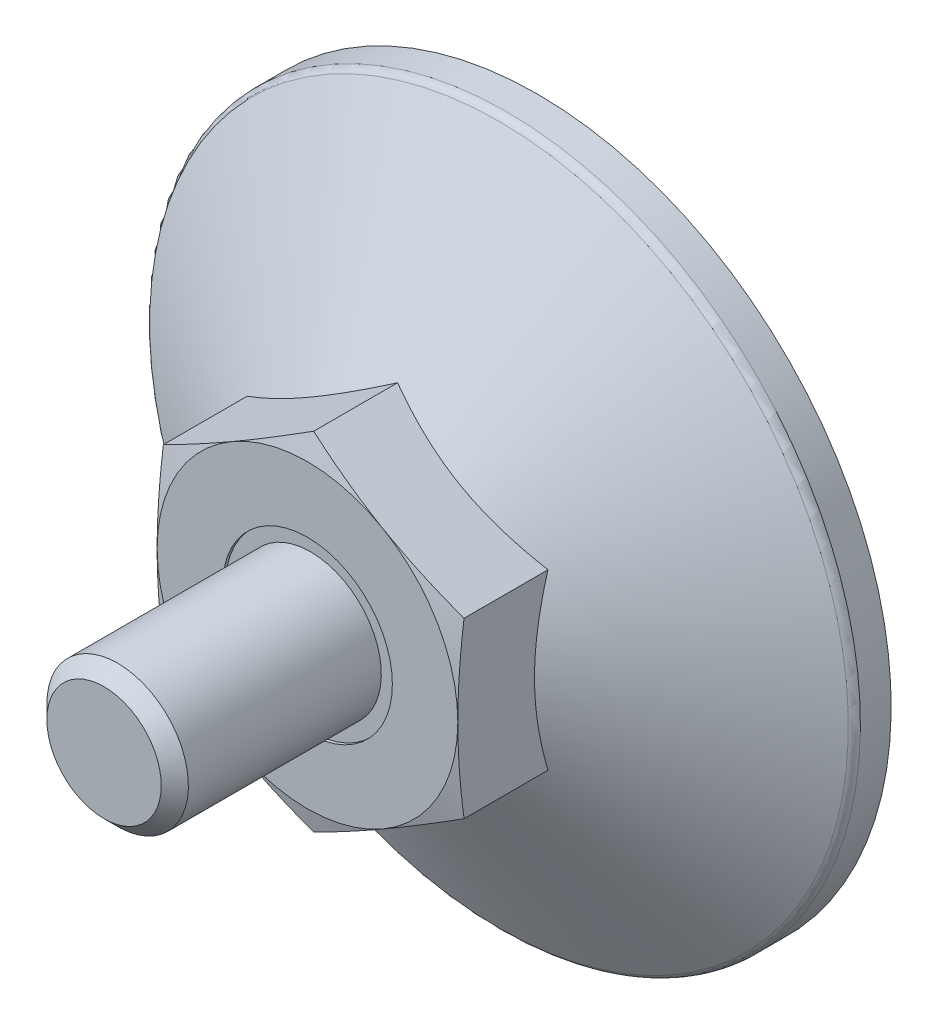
ISO-10303-21;
HEADER;
FILE_DESCRIPTION(('STEP AP214'),'2;1');
FILE_NAME('part.step','',(''),(''),'','','');
FILE_SCHEMA(('AUTOMOTIVE_DESIGN { 1 0 10303 214 1 1 1 1 }'));
ENDSEC;
DATA;
#1=APPLICATION_CONTEXT('core data for automotive mechanical design processes');
#2=APPLICATION_PROTOCOL_DEFINITION('international standard','automotive_design',2000,#1);
#3=PRODUCT_CONTEXT('',#1,'mechanical');
#4=PRODUCT('Part','Part','',(#3));
#5=PRODUCT_RELATED_PRODUCT_CATEGORY('part','',(#4));
#6=PRODUCT_DEFINITION_FORMATION('','',#4);
#7=PRODUCT_DEFINITION_CONTEXT('part definition',#1,'design');
#8=PRODUCT_DEFINITION('design','',#6,#7);
#9=PRODUCT_DEFINITION_SHAPE('','',#8);
#10=(LENGTH_UNIT() NAMED_UNIT(*) SI_UNIT(.MILLI.,.METRE.));
#11=(NAMED_UNIT(*) PLANE_ANGLE_UNIT() SI_UNIT($,.RADIAN.));
#12=(NAMED_UNIT(*) SI_UNIT($,.STERADIAN.) SOLID_ANGLE_UNIT());
#13=UNCERTAINTY_MEASURE_WITH_UNIT(LENGTH_MEASURE(1.E-05),#10,'distance_accuracy_value','');
#14=(GEOMETRIC_REPRESENTATION_CONTEXT(3) GLOBAL_UNCERTAINTY_ASSIGNED_CONTEXT((#13)) GLOBAL_UNIT_ASSIGNED_CONTEXT((#10,
#11,#12)) REPRESENTATION_CONTEXT('',''));
#15=CARTESIAN_POINT('',(0.,0.,0.));
#16=DIRECTION('',(0.,0.,1.));
#17=DIRECTION('',(1.,0.,0.));
#18=AXIS2_PLACEMENT_3D('',#15,#16,#17);
#19=CARTESIAN_POINT('',(0.,9.8149545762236,27.));
#20=DIRECTION('',(0.5,-0.86602540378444,0.));
#21=DIRECTION('',(0.86602540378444,0.5,0.));
#22=AXIS2_PLACEMENT_3D('',#19,#20,#21);
#23=PLANE('',#22);
#24=CARTESIAN_POINT('',(0.000200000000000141,9.81507004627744,12.6476280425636));
#25=CARTESIAN_POINT('',(-0.352800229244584,9.61126526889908,12.7022599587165));
#26=CARTESIAN_POINT('',(-0.706440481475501,9.40709097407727,12.7518566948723));
#27=CARTESIAN_POINT('',(-1.41496987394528,8.99802133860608,12.8389934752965));
#28=CARTESIAN_POINT('',(-1.76985946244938,8.79312573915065,12.8765286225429));
#29=CARTESIAN_POINT('',(-2.47873586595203,8.38385575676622,12.9373509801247));
#30=CARTESIAN_POINT('',(-2.83271788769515,8.17948414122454,12.9607107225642));
#31=CARTESIAN_POINT('',(-3.5411333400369,7.77048028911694,12.9920337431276));
#32=CARTESIAN_POINT('',(-3.89556667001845,7.56584811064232,13.));
#33=CARTESIAN_POINT('',(-4.60443332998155,7.15658375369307,13.));
#34=CARTESIAN_POINT('',(-4.9588666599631,6.95195157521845,12.9920337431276));
#35=CARTESIAN_POINT('',(-5.66728211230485,6.54294772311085,12.9607107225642));
#36=CARTESIAN_POINT('',(-6.02126413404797,6.33857610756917,12.9373509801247));
#37=CARTESIAN_POINT('',(-6.73014053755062,5.92930612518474,12.8765286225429));
#38=CARTESIAN_POINT('',(-7.08503012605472,5.7244105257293,12.8389934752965));
#39=CARTESIAN_POINT('',(-7.7935595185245,5.31534089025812,12.7518566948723));
#40=CARTESIAN_POINT('',(-8.14719977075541,5.11116659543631,12.7022599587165));
#41=CARTESIAN_POINT('',(-8.5002,4.90736181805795,12.6476280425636));
#42=B_SPLINE_CURVE_WITH_KNOTS('',3,(#24,#25,#26,#27,#28,#29,#30,#31,#32,#33,#34,#35,#36,#37,#38,
#39,#40,#41),.UNSPECIFIED.,.F.,.F.,(4,2,2,2,2,2,2,2,4),(0.,1.23382789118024,2.46815608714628,
3.69611406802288,4.92383440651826,6.15155474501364,7.37951272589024,8.61384092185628,
9.84766881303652),.UNSPECIFIED.);
#43=CARTESIAN_POINT('',(0.,9.8149545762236,12.6476589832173));
#44=VERTEX_POINT('',#43);
#45=CARTESIAN_POINT('',(-4.25,7.36121593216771,13.));
#46=VERTEX_POINT('',#45);
#47=EDGE_CURVE('E264',#44,#46,#42,.T.);
#48=ORIENTED_EDGE('',*,*,#47,.F.);
#49=DIRECTION('',(0.,0.,-1.));
#50=VECTOR('',#49,1.);
#51=CARTESIAN_POINT('',(0.,9.8149545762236,27.));
#52=LINE('',#51,#50);
#53=CARTESIAN_POINT('',(0.,9.8149545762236,7.90533871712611));
#54=VERTEX_POINT('',#53);
#55=EDGE_CURVE('E43',#44,#54,#52,.T.);
#56=ORIENTED_EDGE('',*,*,#55,.T.);
#57=CARTESIAN_POINT('',(-8.5002,4.90736181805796,7.90527204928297));
#58=CARTESIAN_POINT('',(-8.31336077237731,5.0152334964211,7.96754195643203));
#59=CARTESIAN_POINT('',(-8.1258249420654,5.12350735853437,8.02698579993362));
#60=CARTESIAN_POINT('',(-7.74923024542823,5.34093440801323,8.13944298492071));
#61=CARTESIAN_POINT('',(-7.56017075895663,5.45008795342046,8.19245355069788));
#62=CARTESIAN_POINT('',(-6.98996524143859,5.77929626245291,8.34079470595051));
#63=CARTESIAN_POINT('',(-6.60656835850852,6.00065055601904,8.42516916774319));
#64=CARTESIAN_POINT('',(-6.03282233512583,6.33190297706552,8.52410807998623));
#65=CARTESIAN_POINT('',(-5.8441872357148,6.44081150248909,8.55229289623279));
#66=CARTESIAN_POINT('',(-5.46606397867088,6.65912106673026,8.59955401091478));
#67=CARTESIAN_POINT('',(-5.27657589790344,6.76852206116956,8.61863111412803));
#68=CARTESIAN_POINT('',(-4.89727347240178,6.98751241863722,8.64719332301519));
#69=CARTESIAN_POINT('',(-4.70745974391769,7.0971014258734,8.65668931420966));
#70=CARTESIAN_POINT('',(-4.3276569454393,7.31638067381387,8.66588571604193));
#71=CARTESIAN_POINT('',(-4.13766788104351,7.42607091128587,8.66558642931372));
#72=CARTESIAN_POINT('',(-3.78247698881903,7.63114046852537,8.65587362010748));
#73=CARTESIAN_POINT('',(-3.61725009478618,7.7265342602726,8.64764492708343));
#74=CARTESIAN_POINT('',(-3.28718328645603,7.91709842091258,8.62393885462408));
#75=CARTESIAN_POINT('',(-3.12234339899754,8.01226877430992,8.60846098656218));
#76=CARTESIAN_POINT('',(-2.62846189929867,8.29741139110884,8.55151947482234));
#77=CARTESIAN_POINT('',(-2.30029449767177,8.48687892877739,8.49955503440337));
#78=CARTESIAN_POINT('',(-1.64047857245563,8.86782383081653,8.36964315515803));
#79=CARTESIAN_POINT('',(-1.30891425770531,9.0592525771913,8.29114502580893));
#80=CARTESIAN_POINT('',(-0.650730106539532,9.43925537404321,8.11298675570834));
#81=CARTESIAN_POINT('',(-0.324101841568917,9.62783429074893,8.01336845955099));
#82=CARTESIAN_POINT('',(0.000199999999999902,9.81507004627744,7.90527204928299));
#83=B_SPLINE_CURVE_WITH_KNOTS('',3,(#57,#58,#59,#60,#61,#62,#63,#64,#65,#66,#67,#68,#69,#70,#71,
#72,#73,#74,#75,#76,#77,#78,#79,#80,#81,#82),.UNSPECIFIED.,.F.,.F.,(4,2,2,2,2,2,2,2,2,2,2,2,4),
(0.,0.673596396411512,1.34748239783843,2.69805431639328,3.35679995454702,4.01548737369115,
4.67342558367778,5.33134346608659,5.90409556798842,6.47688628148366,7.62328361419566,
8.79510569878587,9.96462743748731),.UNSPECIFIED.);
#84=CARTESIAN_POINT('',(-8.5,4.9074772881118,7.90533871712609));
#85=VERTEX_POINT('',#84);
#86=EDGE_CURVE('E233',#85,#54,#83,.T.);
#87=ORIENTED_EDGE('',*,*,#86,.F.);
#88=DIRECTION('',(0.,0.,-1.));
#89=VECTOR('',#88,1.);
#90=CARTESIAN_POINT('',(-8.5,4.9074772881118,27.));
#91=LINE('',#90,#89);
#92=CARTESIAN_POINT('',(-8.5,4.9074772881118,12.6476589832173));
#93=VERTEX_POINT('',#92);
#94=EDGE_CURVE('E277',#93,#85,#91,.T.);
#95=ORIENTED_EDGE('',*,*,#94,.F.);
#96=EDGE_CURVE('E165',#46,#93,#42,.T.);
#97=ORIENTED_EDGE('',*,*,#96,.F.);
#98=EDGE_LOOP('',(#48,#56,#87,#95,#97));
#99=FACE_BOUND('',#98,.T.);
#100=ADVANCED_FACE('F14',(#99),#23,.F.);
#101=CARTESIAN_POINT('',(8.5,4.9074772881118,27.));
#102=DIRECTION('',(-0.5,-0.86602540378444,0.));
#103=DIRECTION('',(0.86602540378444,-0.5,0.));
#104=AXIS2_PLACEMENT_3D('',#101,#102,#103);
#105=PLANE('',#104);
#106=CARTESIAN_POINT('',(8.5002,4.90736181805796,12.6476280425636));
#107=CARTESIAN_POINT('',(8.14719977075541,5.11116659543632,12.7022599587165));
#108=CARTESIAN_POINT('',(7.7935595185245,5.31534089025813,12.7518566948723));
#109=CARTESIAN_POINT('',(7.08503012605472,5.72441052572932,12.8389934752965));
#110=CARTESIAN_POINT('',(6.73014053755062,5.92930612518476,12.8765286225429));
#111=CARTESIAN_POINT('',(6.02126413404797,6.33857610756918,12.9373509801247));
#112=CARTESIAN_POINT('',(5.66728211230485,6.54294772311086,12.9607107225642));
#113=CARTESIAN_POINT('',(4.9588666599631,6.95195157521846,12.9920337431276));
#114=CARTESIAN_POINT('',(4.60443332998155,7.15658375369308,13.));
#115=CARTESIAN_POINT('',(3.89556667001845,7.56584811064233,13.));
#116=CARTESIAN_POINT('',(3.5411333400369,7.77048028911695,12.9920337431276));
#117=CARTESIAN_POINT('',(2.83271788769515,8.17948414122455,12.9607107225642));
#118=CARTESIAN_POINT('',(2.47873586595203,8.38385575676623,12.9373509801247));
#119=CARTESIAN_POINT('',(1.76985946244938,8.79312573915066,12.8765286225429));
#120=CARTESIAN_POINT('',(1.41496987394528,8.9980213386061,12.8389934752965));
#121=CARTESIAN_POINT('',(0.706440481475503,9.40709097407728,12.7518566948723));
#122=CARTESIAN_POINT('',(0.352800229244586,9.61126526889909,12.7022599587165));
#123=CARTESIAN_POINT('',(-0.000200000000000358,9.81507004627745,12.6476280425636));
#124=B_SPLINE_CURVE_WITH_KNOTS('',3,(#106,#107,#108,#109,#110,#111,#112,#113,#114,#115,#116,
#117,#118,#119,#120,#121,#122,#123),.UNSPECIFIED.,.F.,.F.,(4,2,2,2,2,2,2,2,4),(0.,
1.23382789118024,2.46815608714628,3.69611406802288,4.92383440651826,6.15155474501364,
7.37951272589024,8.61384092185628,9.84766881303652),.UNSPECIFIED.);
#125=CARTESIAN_POINT('',(8.5,4.9074772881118,12.6476589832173));
#126=VERTEX_POINT('',#125);
#127=CARTESIAN_POINT('',(4.25,7.36121593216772,13.));
#128=VERTEX_POINT('',#127);
#129=EDGE_CURVE('E120',#126,#128,#124,.T.);
#130=ORIENTED_EDGE('',*,*,#129,.F.);
#131=DIRECTION('',(0.,0.,-1.));
#132=VECTOR('',#131,1.);
#133=CARTESIAN_POINT('',(8.5,4.9074772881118,27.));
#134=LINE('',#133,#132);
#135=CARTESIAN_POINT('',(8.5,4.9074772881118,7.90533871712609));
#136=VERTEX_POINT('',#135);
#137=EDGE_CURVE('E127',#126,#136,#134,.T.);
#138=ORIENTED_EDGE('',*,*,#137,.T.);
#139=CARTESIAN_POINT('',(-0.0002,9.81507004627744,7.90527204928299));
#140=CARTESIAN_POINT('',(0.186639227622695,9.7071983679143,7.96754195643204));
#141=CARTESIAN_POINT('',(0.374175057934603,9.59892450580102,8.02698579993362));
#142=CARTESIAN_POINT('',(0.750769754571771,9.38149745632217,8.13944298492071));
#143=CARTESIAN_POINT('',(0.939829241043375,9.27234391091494,8.19245355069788));
#144=CARTESIAN_POINT('',(1.51003475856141,8.94313560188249,8.34079470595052));
#145=CARTESIAN_POINT('',(1.89343164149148,8.72178130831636,8.42516916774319));
#146=CARTESIAN_POINT('',(2.46717766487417,8.39052888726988,8.52410807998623));
#147=CARTESIAN_POINT('',(2.6558127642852,8.28162036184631,8.55229289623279));
#148=CARTESIAN_POINT('',(3.03393602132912,8.06331079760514,8.59955401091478));
#149=CARTESIAN_POINT('',(3.22342410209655,7.95390980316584,8.61863111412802));
#150=CARTESIAN_POINT('',(3.60272652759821,7.73491944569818,8.64719332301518));
#151=CARTESIAN_POINT('',(3.79254025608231,7.62533043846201,8.65668931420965));
#152=CARTESIAN_POINT('',(4.1723430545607,7.40605119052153,8.66588571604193));
#153=CARTESIAN_POINT('',(4.36233211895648,7.29636095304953,8.66558642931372));
#154=CARTESIAN_POINT('',(4.71752301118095,7.09129139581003,8.65587362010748));
#155=CARTESIAN_POINT('',(4.88274990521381,6.9958976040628,8.64764492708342));
#156=CARTESIAN_POINT('',(5.21281671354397,6.80533344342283,8.62393885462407));
#157=CARTESIAN_POINT('',(5.37765660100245,6.71016309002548,8.60846098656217));
#158=CARTESIAN_POINT('',(5.87153810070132,6.42502047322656,8.55151947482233));
#159=CARTESIAN_POINT('',(6.19970550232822,6.23555293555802,8.49955503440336));
#160=CARTESIAN_POINT('',(6.85952142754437,5.85460803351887,8.36964315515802));
#161=CARTESIAN_POINT('',(7.19108574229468,5.6631792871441,8.29114502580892));
#162=CARTESIAN_POINT('',(7.84926989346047,5.28317649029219,8.11298675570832));
#163=CARTESIAN_POINT('',(8.17589815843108,5.09459757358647,8.01336845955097));
#164=CARTESIAN_POINT('',(8.5002,4.90736181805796,7.90527204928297));
#165=B_SPLINE_CURVE_WITH_KNOTS('',3,(#139,#140,#141,#142,#143,#144,#145,#146,#147,#148,#149,
#150,#151,#152,#153,#154,#155,#156,#157,#158,#159,#160,#161,#162,#163,#164),.UNSPECIFIED.,.F.,
.F.,(4,2,2,2,2,2,2,2,2,2,2,2,4),(0.,0.673596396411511,1.34748239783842,2.69805431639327,
3.35679995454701,4.01548737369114,4.67342558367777,5.33134346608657,5.90409556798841,
6.47688628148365,7.62328361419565,8.79510569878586,9.96462743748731),.UNSPECIFIED.);
#166=EDGE_CURVE('E227',#54,#136,#165,.T.);
#167=ORIENTED_EDGE('',*,*,#166,.F.);
#168=ORIENTED_EDGE('',*,*,#55,.F.);
#169=EDGE_CURVE('E137',#128,#44,#124,.T.);
#170=ORIENTED_EDGE('',*,*,#169,.F.);
#171=EDGE_LOOP('',(#130,#138,#167,#168,#170));
#172=FACE_BOUND('',#171,.T.);
#173=ADVANCED_FACE('F239',(#172),#105,.F.);
#174=CARTESIAN_POINT('',(8.5,-4.9074772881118,27.));
#175=DIRECTION('',(-1.,0.,0.));
#176=DIRECTION('',(0.,-1.,0.));
#177=AXIS2_PLACEMENT_3D('',#174,#175,#176);
#178=PLANE('',#177);
#179=CARTESIAN_POINT('',(8.5,-12.9812680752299,11.1199211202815));
#180=CARTESIAN_POINT('',(8.5,-12.5956568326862,11.2063397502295));
#181=CARTESIAN_POINT('',(8.5,-12.2098043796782,11.2917013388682));
#182=CARTESIAN_POINT('',(8.5,-11.4374985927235,11.4597398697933));
#183=CARTESIAN_POINT('',(8.5,-11.0510452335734,11.5424166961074));
#184=CARTESIAN_POINT('',(8.5,-10.2770728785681,11.7045871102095));
#185=CARTESIAN_POINT('',(8.5,-9.88955320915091,11.7840774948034));
#186=CARTESIAN_POINT('',(8.5,-9.113707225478,11.939016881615));
#187=CARTESIAN_POINT('',(8.5,-8.72538091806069,12.0144659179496));
#188=CARTESIAN_POINT('',(8.5,-7.9508785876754,12.1597787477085));
#189=CARTESIAN_POINT('',(8.5,-7.56471004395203,12.2296822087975));
#190=CARTESIAN_POINT('',(8.5,-6.79131956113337,12.3633853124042));
#191=CARTESIAN_POINT('',(8.5,-6.40409764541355,12.427185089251));
#192=CARTESIAN_POINT('',(8.5,-5.62852534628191,12.5472441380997));
#193=CARTESIAN_POINT('',(8.5,-5.2401751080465,12.6035043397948));
#194=CARTESIAN_POINT('',(8.5,-4.46223885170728,12.7068261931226));
#195=CARTESIAN_POINT('',(8.5,-4.07265283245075,12.7538878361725));
#196=CARTESIAN_POINT('',(8.5,-3.28785009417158,12.8374797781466));
#197=CARTESIAN_POINT('',(8.5,-2.8926197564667,12.8738841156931));
#198=CARTESIAN_POINT('',(8.5,-2.10116564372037,12.9336499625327));
#199=CARTESIAN_POINT('',(8.5,-1.70494189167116,12.957011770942));
#200=CARTESIAN_POINT('',(8.5,-0.91207568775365,12.9893299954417));
#201=CARTESIAN_POINT('',(8.5,-0.515433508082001,12.9982929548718));
#202=CARTESIAN_POINT('',(8.5,0.277907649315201,13.0012624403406));
#203=CARTESIAN_POINT('',(8.5,0.674606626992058,12.995268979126));
#204=CARTESIAN_POINT('',(8.5,1.46894754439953,12.9686626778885));
#205=CARTESIAN_POINT('',(8.5,1.86658767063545,12.9479967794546));
#206=CARTESIAN_POINT('',(8.5,2.66093265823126,12.8932251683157));
#207=CARTESIAN_POINT('',(8.5,3.05763749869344,12.8591191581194));
#208=CARTESIAN_POINT('',(8.5,3.85010859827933,12.7791899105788));
#209=CARTESIAN_POINT('',(8.5,4.24587407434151,12.7333590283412));
#210=CARTESIAN_POINT('',(8.5,5.03613139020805,12.6318868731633));
#211=CARTESIAN_POINT('',(8.5,5.43062322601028,12.5762455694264));
#212=CARTESIAN_POINT('',(8.5,6.19224889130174,12.4608890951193));
#213=CARTESIAN_POINT('',(8.5,6.5594615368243,12.4016890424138));
#214=CARTESIAN_POINT('',(8.5,7.29291921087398,12.2775441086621));
#215=CARTESIAN_POINT('',(8.5,7.659164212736,12.2125990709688));
#216=CARTESIAN_POINT('',(8.5,8.39082010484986,12.0780134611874));
#217=CARTESIAN_POINT('',(8.5,8.75623091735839,12.0083724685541));
#218=CARTESIAN_POINT('',(8.5,9.48630347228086,11.8652581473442));
#219=CARTESIAN_POINT('',(8.5,9.85096520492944,11.7917847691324));
#220=CARTESIAN_POINT('',(8.5,10.5797225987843,11.6416823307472));
#221=CARTESIAN_POINT('',(8.5,10.9438181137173,11.5650525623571));
#222=CARTESIAN_POINT('',(8.5,11.671455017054,11.4092021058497));
#223=CARTESIAN_POINT('',(8.5,12.0349964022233,11.3299814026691));
#224=CARTESIAN_POINT('',(8.5,13.124864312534,11.0891319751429));
#225=CARTESIAN_POINT('',(8.5,13.8504839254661,10.9243056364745));
#226=CARTESIAN_POINT('',(8.5,15.2932139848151,10.5903539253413));
#227=CARTESIAN_POINT('',(8.5,16.0103379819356,10.4212867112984));
#228=CARTESIAN_POINT('',(8.5,17.443585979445,10.0789154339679));
#229=CARTESIAN_POINT('',(8.5,18.159709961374,9.90561129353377));
#230=CARTESIAN_POINT('',(8.5,19.590309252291,9.55609201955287));
#231=CARTESIAN_POINT('',(8.5,20.3047855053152,9.37988074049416));
#232=CARTESIAN_POINT('',(8.5,21.7331156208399,9.0250518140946));
#233=CARTESIAN_POINT('',(8.5,22.4469695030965,8.84643424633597));
#234=CARTESIAN_POINT('',(8.5,23.1606065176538,8.66696399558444));
#235=B_SPLINE_CURVE_WITH_KNOTS('',3,(#179,#180,#181,#182,#183,#184,#185,#186,#187,#188,#189,
#190,#191,#192,#193,#194,#195,#196,#197,#198,#199,#200,#201,#202,#203,#204,#205,#206,#207,#208,
#209,#210,#211,#212,#213,#214,#215,#216,#217,#218,#219,#220,#221,#222,#223,#224,#225,#226,#227,
#228,#229,#230,#231,#232,#233,#234),.UNSPECIFIED.,.F.,.F.,(4,2,2,2,2,2,2,2,2,2,2,2,2,2,2,2,2,2,
2,2,2,2,2,2,2,2,2,4),(0.,1.18553335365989,2.37111785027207,3.55786571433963,4.74460355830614,
5.92189775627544,7.09916603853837,8.27628901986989,9.45341309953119,10.6439348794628,
11.8344293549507,13.0243826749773,14.2143349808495,15.4086124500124,16.6029163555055,
17.7980009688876,18.9930893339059,20.1088975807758,21.2247362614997,22.3406750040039,
23.456628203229,24.572833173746,25.6890446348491,27.9213163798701,30.1316532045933,
32.3420303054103,34.5496808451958,36.7572585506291),.UNSPECIFIED.);
#236=CARTESIAN_POINT('',(8.5,-4.90747728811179,12.6476589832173));
#237=VERTEX_POINT('',#236);
#238=CARTESIAN_POINT('',(8.5,0.,13.));
#239=VERTEX_POINT('',#238);
#240=EDGE_CURVE('E95',#237,#239,#235,.T.);
#241=ORIENTED_EDGE('',*,*,#240,.F.);
#242=DIRECTION('',(0.,0.,-1.));
#243=VECTOR('',#242,1.);
#244=CARTESIAN_POINT('',(8.5,-4.9074772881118,27.));
#245=LINE('',#244,#243);
#246=CARTESIAN_POINT('',(8.5,-4.9074772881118,7.90533871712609));
#247=VERTEX_POINT('',#246);
#248=EDGE_CURVE('E270',#237,#247,#245,.T.);
#249=ORIENTED_EDGE('',*,*,#248,.T.);
#250=CARTESIAN_POINT('',(8.5,12.7492767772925,4.72527230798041));
#251=CARTESIAN_POINT('',(8.5,12.3811478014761,4.90206026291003));
#252=CARTESIAN_POINT('',(8.5,12.0121249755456,5.07702151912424));
#253=CARTESIAN_POINT('',(8.5,11.2718137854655,5.42225230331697));
#254=CARTESIAN_POINT('',(8.5,10.9005250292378,5.59252098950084));
#255=CARTESIAN_POINT('',(8.5,10.1530767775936,5.92827896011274));
#256=CARTESIAN_POINT('',(8.5,9.77690140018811,6.09373302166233));
#257=CARTESIAN_POINT('',(8.5,9.02139912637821,6.41725455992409));
#258=CARTESIAN_POINT('',(8.5,8.64207239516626,6.57532242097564));
#259=CARTESIAN_POINT('',(8.5,7.86979942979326,6.88607334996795));
#260=CARTESIAN_POINT('',(8.5,7.47675434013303,7.03851219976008));
#261=CARTESIAN_POINT('',(8.5,6.68591204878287,7.33076935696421));
#262=CARTESIAN_POINT('',(8.5,6.28811429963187,7.47058619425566));
#263=CARTESIAN_POINT('',(8.5,5.48802263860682,7.733611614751));
#264=CARTESIAN_POINT('',(8.5,5.08574124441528,7.85685783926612));
#265=CARTESIAN_POINT('',(8.5,4.27544970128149,8.08251258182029));
#266=CARTESIAN_POINT('',(8.5,3.86744153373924,8.18492812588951));
#267=CARTESIAN_POINT('',(8.5,3.04728386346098,8.36327495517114));
#268=CARTESIAN_POINT('',(8.5,2.6351585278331,8.43931422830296));
#269=CARTESIAN_POINT('',(8.5,2.01359122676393,8.53003978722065));
#270=CARTESIAN_POINT('',(8.5,1.80582110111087,8.55639399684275));
#271=CARTESIAN_POINT('',(8.5,1.38940213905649,8.60080126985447));
#272=CARTESIAN_POINT('',(8.5,1.18075338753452,8.61885511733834));
#273=CARTESIAN_POINT('',(8.5,0.765376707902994,8.64609671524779));
#274=CARTESIAN_POINT('',(8.5,0.558655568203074,8.65538769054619));
#275=CARTESIAN_POINT('',(8.5,0.1450067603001,8.66526416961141));
#276=CARTESIAN_POINT('',(8.5,-0.0619209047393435,8.6658498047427));
#277=CARTESIAN_POINT('',(8.5,-0.475626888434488,8.65830085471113));
#278=CARTESIAN_POINT('',(8.5,-0.682405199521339,8.65016585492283));
#279=CARTESIAN_POINT('',(8.5,-1.09545270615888,8.625363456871));
#280=CARTESIAN_POINT('',(8.5,-1.30172187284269,8.60869558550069));
#281=CARTESIAN_POINT('',(8.5,-1.81090940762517,8.55735076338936));
#282=CARTESIAN_POINT('',(8.5,-2.11335210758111,8.51788364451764));
#283=CARTESIAN_POINT('',(8.5,-2.71570235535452,8.4228634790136));
#284=CARTESIAN_POINT('',(8.5,-3.01560949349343,8.36730788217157));
#285=CARTESIAN_POINT('',(8.5,-3.61268959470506,8.2420877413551));
#286=CARTESIAN_POINT('',(8.5,-3.90986014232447,8.17241178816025));
#287=CARTESIAN_POINT('',(8.5,-4.50108875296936,8.02104250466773));
#288=CARTESIAN_POINT('',(8.5,-4.79514688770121,7.93934945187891));
#289=CARTESIAN_POINT('',(8.5,-5.3871494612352,7.7638116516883));
#290=CARTESIAN_POINT('',(8.5,-5.68502188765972,7.6697256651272));
#291=CARTESIAN_POINT('',(8.5,-6.27782977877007,7.4727599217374));
#292=CARTESIAN_POINT('',(8.5,-6.57276522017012,7.36988009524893));
#293=CARTESIAN_POINT('',(8.5,-7.15987047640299,7.15687683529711));
#294=CARTESIAN_POINT('',(8.5,-7.45204129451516,7.04675615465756));
#295=CARTESIAN_POINT('',(8.5,-8.03401937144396,6.82048197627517));
#296=CARTESIAN_POINT('',(8.5,-8.32382669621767,6.70432864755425));
#297=CARTESIAN_POINT('',(8.5,-8.8985343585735,6.468166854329));
#298=CARTESIAN_POINT('',(8.5,-9.18345493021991,6.34820749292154));
#299=CARTESIAN_POINT('',(8.5,-9.75152375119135,6.10415692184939));
#300=CARTESIAN_POINT('',(8.5,-10.034671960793,5.98006561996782));
#301=CARTESIAN_POINT('',(8.5,-10.8818575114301,5.60257794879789));
#302=CARTESIAN_POINT('',(8.5,-11.4435817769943,5.34399030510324));
#303=CARTESIAN_POINT('',(8.5,-12.5625477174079,4.81675169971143));
#304=CARTESIAN_POINT('',(8.5,-13.1197873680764,4.54809647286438));
#305=CARTESIAN_POINT('',(8.5,-14.2306052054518,4.00340707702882));
#306=CARTESIAN_POINT('',(8.5,-14.7841835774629,3.72737328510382));
#307=CARTESIAN_POINT('',(8.5,-15.8894273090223,3.16924748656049));
#308=CARTESIAN_POINT('',(8.5,-16.4410879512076,2.88714616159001));
#309=CARTESIAN_POINT('',(8.5,-17.5421722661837,2.31860293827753));
#310=CARTESIAN_POINT('',(8.5,-18.0915959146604,2.03216099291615));
#311=CARTESIAN_POINT('',(8.5,-19.1885131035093,1.45593769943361));
#312=CARTESIAN_POINT('',(8.5,-19.7360070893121,1.1661571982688));
#313=CARTESIAN_POINT('',(8.5,-20.8295421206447,0.583866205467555));
#314=CARTESIAN_POINT('',(8.5,-21.3755831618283,0.291355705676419));
#315=CARTESIAN_POINT('',(8.5,-22.8810608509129,-0.519031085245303));
#316=CARTESIAN_POINT('',(8.5,-23.8392547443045,-1.03921546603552));
#317=CARTESIAN_POINT('',(8.5,-25.7530641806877,-2.08445783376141));
#318=CARTESIAN_POINT('',(8.5,-26.708679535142,-2.60951616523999));
#319=CARTESIAN_POINT('',(8.5,-28.6148788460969,-3.66152013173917));
#320=CARTESIAN_POINT('',(8.5,-29.565469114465,-4.18845433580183));
#321=CARTESIAN_POINT('',(8.5,-30.9901906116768,-4.98085413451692));
#322=CARTESIAN_POINT('',(8.5,-31.4648842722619,-5.24530955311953));
#323=CARTESIAN_POINT('',(8.5,-32.4139385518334,-5.77481644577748));
#324=CARTESIAN_POINT('',(8.5,-32.8882991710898,-6.03986791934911));
#325=CARTESIAN_POINT('',(8.5,-33.3625145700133,-6.30517901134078));
#326=B_SPLINE_CURVE_WITH_KNOTS('',3,(#250,#251,#252,#253,#254,#255,#256,#257,#258,#259,#260,
#261,#262,#263,#264,#265,#266,#267,#268,#269,#270,#271,#272,#273,#274,#275,#276,#277,#278,#279,
#280,#281,#282,#283,#284,#285,#286,#287,#288,#289,#290,#291,#292,#293,#294,#295,#296,#297,#298,
#299,#300,#301,#302,#303,#304,#305,#306,#307,#308,#309,#310,#311,#312,#313,#314,#315,#316,#317,
#318,#319,#320,#321,#322,#323,#324,#325),.UNSPECIFIED.,.F.,.F.,(4,2,2,2,2,2,2,2,2,2,2,2,2,2,2,2,
2,2,2,2,2,2,2,2,2,2,2,2,2,2,2,2,2,2,2,2,2,4),(0.,1.22515253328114,2.45052343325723,
3.6833213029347,4.91605495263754,6.18059988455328,7.44529191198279,8.70706073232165,
9.96840325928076,11.2245189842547,11.852683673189,12.4807890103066,13.1013994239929,
13.7220004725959,14.3426310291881,14.9632960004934,15.8778021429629,16.7924533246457,
17.7078465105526,18.6232185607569,19.5601888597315,20.4971665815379,21.433790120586,
22.3703874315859,23.297780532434,24.225194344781,26.0801973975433,27.9359954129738,
29.7916987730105,31.6504906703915,33.5093027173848,35.3676531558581,37.2260091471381,
40.4968499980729,43.7679238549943,47.0285209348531,48.6586852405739,50.2888482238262),.UNSPECIFIED.);
#327=EDGE_CURVE('E193',#136,#247,#326,.T.);
#328=ORIENTED_EDGE('',*,*,#327,.F.);
#329=ORIENTED_EDGE('',*,*,#137,.F.);
#330=EDGE_CURVE('E106',#239,#126,#235,.T.);
#331=ORIENTED_EDGE('',*,*,#330,.F.);
#332=EDGE_LOOP('',(#241,#249,#328,#329,#331));
#333=FACE_BOUND('',#332,.T.);
#334=ADVANCED_FACE('F125',(#333),#178,.F.);
#335=CARTESIAN_POINT('',(0.,-9.8149545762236,27.));
#336=DIRECTION('',(-0.5,0.86602540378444,0.));
#337=DIRECTION('',(-0.86602540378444,-0.5,0.));
#338=AXIS2_PLACEMENT_3D('',#335,#336,#337);
#339=PLANE('',#338);
#340=CARTESIAN_POINT('',(-0.000200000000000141,-9.81507004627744,12.6476280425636));
#341=CARTESIAN_POINT('',(0.352800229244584,-9.61126526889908,12.7022599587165));
#342=CARTESIAN_POINT('',(0.706440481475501,-9.40709097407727,12.7518566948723));
#343=CARTESIAN_POINT('',(1.41496987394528,-8.99802133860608,12.8389934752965));
#344=CARTESIAN_POINT('',(1.76985946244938,-8.79312573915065,12.8765286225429));
#345=CARTESIAN_POINT('',(2.47873586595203,-8.38385575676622,12.9373509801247));
#346=CARTESIAN_POINT('',(2.83271788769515,-8.17948414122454,12.9607107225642));
#347=CARTESIAN_POINT('',(3.5411333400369,-7.77048028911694,12.9920337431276));
#348=CARTESIAN_POINT('',(3.89556667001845,-7.56584811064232,13.));
#349=CARTESIAN_POINT('',(4.60443332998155,-7.15658375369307,13.));
#350=CARTESIAN_POINT('',(4.9588666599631,-6.95195157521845,12.9920337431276));
#351=CARTESIAN_POINT('',(5.66728211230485,-6.54294772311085,12.9607107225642));
#352=CARTESIAN_POINT('',(6.02126413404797,-6.33857610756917,12.9373509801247));
#353=CARTESIAN_POINT('',(6.73014053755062,-5.92930612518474,12.8765286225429));
#354=CARTESIAN_POINT('',(7.08503012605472,-5.7244105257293,12.8389934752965));
#355=CARTESIAN_POINT('',(7.7935595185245,-5.31534089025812,12.7518566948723));
#356=CARTESIAN_POINT('',(8.14719977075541,-5.11116659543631,12.7022599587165));
#357=CARTESIAN_POINT('',(8.5002,-4.90736181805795,12.6476280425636));
#358=B_SPLINE_CURVE_WITH_KNOTS('',3,(#340,#341,#342,#343,#344,#345,#346,#347,#348,#349,#350,
#351,#352,#353,#354,#355,#356,#357),.UNSPECIFIED.,.F.,.F.,(4,2,2,2,2,2,2,2,4),(0.,
1.23382789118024,2.46815608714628,3.69611406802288,4.92383440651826,6.15155474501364,
7.37951272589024,8.61384092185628,9.84766881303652),.UNSPECIFIED.);
#359=CARTESIAN_POINT('',(0.,-9.81495457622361,12.6476589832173));
#360=VERTEX_POINT('',#359);
#361=CARTESIAN_POINT('',(4.25,-7.36121593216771,13.));
#362=VERTEX_POINT('',#361);
#363=EDGE_CURVE('E129',#360,#362,#358,.T.);
#364=ORIENTED_EDGE('',*,*,#363,.F.);
#365=DIRECTION('',(0.,0.,-1.));
#366=VECTOR('',#365,1.);
#367=CARTESIAN_POINT('',(0.,-9.8149545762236,27.));
#368=LINE('',#367,#366);
#369=CARTESIAN_POINT('',(0.,-9.8149545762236,7.90533871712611));
#370=VERTEX_POINT('',#369);
#371=EDGE_CURVE('E274',#360,#370,#368,.T.);
#372=ORIENTED_EDGE('',*,*,#371,.T.);
#373=CARTESIAN_POINT('',(8.5002,-4.90736181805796,7.90527204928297));
#374=CARTESIAN_POINT('',(8.31336077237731,-5.0152334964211,7.96754195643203));
#375=CARTESIAN_POINT('',(8.1258249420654,-5.12350735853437,8.02698579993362));
#376=CARTESIAN_POINT('',(7.74923024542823,-5.34093440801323,8.13944298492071));
#377=CARTESIAN_POINT('',(7.56017075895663,-5.45008795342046,8.19245355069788));
#378=CARTESIAN_POINT('',(6.98996524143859,-5.77929626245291,8.34079470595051));
#379=CARTESIAN_POINT('',(6.60656835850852,-6.00065055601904,8.42516916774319));
#380=CARTESIAN_POINT('',(6.03282233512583,-6.33190297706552,8.52410807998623));
#381=CARTESIAN_POINT('',(5.8441872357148,-6.44081150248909,8.55229289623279));
#382=CARTESIAN_POINT('',(5.46606397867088,-6.65912106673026,8.59955401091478));
#383=CARTESIAN_POINT('',(5.27657589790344,-6.76852206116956,8.61863111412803));
#384=CARTESIAN_POINT('',(4.89727347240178,-6.98751241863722,8.64719332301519));
#385=CARTESIAN_POINT('',(4.70745974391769,-7.0971014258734,8.65668931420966));
#386=CARTESIAN_POINT('',(4.3276569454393,-7.31638067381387,8.66588571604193));
#387=CARTESIAN_POINT('',(4.13766788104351,-7.42607091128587,8.66558642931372));
#388=CARTESIAN_POINT('',(3.78247698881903,-7.63114046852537,8.65587362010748));
#389=CARTESIAN_POINT('',(3.61725009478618,-7.7265342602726,8.64764492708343));
#390=CARTESIAN_POINT('',(3.28718328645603,-7.91709842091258,8.62393885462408));
#391=CARTESIAN_POINT('',(3.12234339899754,-8.01226877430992,8.60846098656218));
#392=CARTESIAN_POINT('',(2.62846189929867,-8.29741139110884,8.55151947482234));
#393=CARTESIAN_POINT('',(2.30029449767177,-8.48687892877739,8.49955503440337));
#394=CARTESIAN_POINT('',(1.64047857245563,-8.86782383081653,8.36964315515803));
#395=CARTESIAN_POINT('',(1.30891425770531,-9.0592525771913,8.29114502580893));
#396=CARTESIAN_POINT('',(0.650730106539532,-9.43925537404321,8.11298675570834));
#397=CARTESIAN_POINT('',(0.324101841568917,-9.62783429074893,8.01336845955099));
#398=CARTESIAN_POINT('',(-0.000199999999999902,-9.81507004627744,7.90527204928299));
#399=B_SPLINE_CURVE_WITH_KNOTS('',3,(#373,#374,#375,#376,#377,#378,#379,#380,#381,#382,#383,
#384,#385,#386,#387,#388,#389,#390,#391,#392,#393,#394,#395,#396,#397,#398),.UNSPECIFIED.,.F.,
.F.,(4,2,2,2,2,2,2,2,2,2,2,2,4),(0.,0.673596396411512,1.34748239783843,2.69805431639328,
3.35679995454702,4.01548737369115,4.67342558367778,5.33134346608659,5.90409556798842,
6.47688628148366,7.62328361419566,8.79510569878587,9.96462743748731),.UNSPECIFIED.);
#400=EDGE_CURVE('E184',#247,#370,#399,.T.);
#401=ORIENTED_EDGE('',*,*,#400,.F.);
#402=ORIENTED_EDGE('',*,*,#248,.F.);
#403=EDGE_CURVE('E101',#362,#237,#358,.T.);
#404=ORIENTED_EDGE('',*,*,#403,.F.);
#405=EDGE_LOOP('',(#364,#372,#401,#402,#404));
#406=FACE_BOUND('',#405,.T.);
#407=ADVANCED_FACE('F176',(#406),#339,.F.);
#408=CARTESIAN_POINT('',(-8.5,-4.9074772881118,27.));
#409=DIRECTION('',(0.5,0.86602540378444,0.));
#410=DIRECTION('',(-0.86602540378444,0.5,0.));
#411=AXIS2_PLACEMENT_3D('',#408,#409,#410);
#412=PLANE('',#411);
#413=CARTESIAN_POINT('',(-8.5002,-4.90736181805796,12.6476280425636));
#414=CARTESIAN_POINT('',(-8.14719977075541,-5.11116659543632,12.7022599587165));
#415=CARTESIAN_POINT('',(-7.7935595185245,-5.31534089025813,12.7518566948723));
#416=CARTESIAN_POINT('',(-7.08503012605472,-5.72441052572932,12.8389934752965));
#417=CARTESIAN_POINT('',(-6.73014053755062,-5.92930612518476,12.8765286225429));
#418=CARTESIAN_POINT('',(-6.02126413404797,-6.33857610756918,12.9373509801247));
#419=CARTESIAN_POINT('',(-5.66728211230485,-6.54294772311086,12.9607107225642));
#420=CARTESIAN_POINT('',(-4.9588666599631,-6.95195157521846,12.9920337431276));
#421=CARTESIAN_POINT('',(-4.60443332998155,-7.15658375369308,13.));
#422=CARTESIAN_POINT('',(-3.89556667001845,-7.56584811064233,13.));
#423=CARTESIAN_POINT('',(-3.5411333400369,-7.77048028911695,12.9920337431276));
#424=CARTESIAN_POINT('',(-2.83271788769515,-8.17948414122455,12.9607107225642));
#425=CARTESIAN_POINT('',(-2.47873586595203,-8.38385575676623,12.9373509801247));
#426=CARTESIAN_POINT('',(-1.76985946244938,-8.79312573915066,12.8765286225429));
#427=CARTESIAN_POINT('',(-1.41496987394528,-8.9980213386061,12.8389934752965));
#428=CARTESIAN_POINT('',(-0.706440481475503,-9.40709097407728,12.7518566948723));
#429=CARTESIAN_POINT('',(-0.352800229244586,-9.61126526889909,12.7022599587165));
#430=CARTESIAN_POINT('',(0.000200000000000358,-9.81507004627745,12.6476280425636));
#431=B_SPLINE_CURVE_WITH_KNOTS('',3,(#413,#414,#415,#416,#417,#418,#419,#420,#421,#422,#423,
#424,#425,#426,#427,#428,#429,#430),.UNSPECIFIED.,.F.,.F.,(4,2,2,2,2,2,2,2,4),(0.,
1.23382789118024,2.46815608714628,3.69611406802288,4.92383440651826,6.15155474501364,
7.37951272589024,8.61384092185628,9.84766881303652),.UNSPECIFIED.);
#432=CARTESIAN_POINT('',(-8.5,-4.9074772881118,12.6476589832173));
#433=VERTEX_POINT('',#432);
#434=CARTESIAN_POINT('',(-4.25,-7.36121593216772,13.));
#435=VERTEX_POINT('',#434);
#436=EDGE_CURVE('E157',#433,#435,#431,.T.);
#437=ORIENTED_EDGE('',*,*,#436,.F.);
#438=DIRECTION('',(0.,0.,-1.));
#439=VECTOR('',#438,1.);
#440=CARTESIAN_POINT('',(-8.5,-4.9074772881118,27.));
#441=LINE('',#440,#439);
#442=CARTESIAN_POINT('',(-8.5,-4.9074772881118,7.90533871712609));
#443=VERTEX_POINT('',#442);
#444=EDGE_CURVE('E276',#433,#443,#441,.T.);
#445=ORIENTED_EDGE('',*,*,#444,.T.);
#446=CARTESIAN_POINT('',(0.0002,-9.81507004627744,7.90527204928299));
#447=CARTESIAN_POINT('',(-0.186639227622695,-9.7071983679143,7.96754195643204));
#448=CARTESIAN_POINT('',(-0.374175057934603,-9.59892450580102,8.02698579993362));
#449=CARTESIAN_POINT('',(-0.750769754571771,-9.38149745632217,8.13944298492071));
#450=CARTESIAN_POINT('',(-0.939829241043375,-9.27234391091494,8.19245355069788));
#451=CARTESIAN_POINT('',(-1.51003475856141,-8.94313560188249,8.34079470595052));
#452=CARTESIAN_POINT('',(-1.89343164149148,-8.72178130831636,8.42516916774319));
#453=CARTESIAN_POINT('',(-2.46717766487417,-8.39052888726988,8.52410807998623));
#454=CARTESIAN_POINT('',(-2.6558127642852,-8.28162036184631,8.55229289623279));
#455=CARTESIAN_POINT('',(-3.03393602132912,-8.06331079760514,8.59955401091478));
#456=CARTESIAN_POINT('',(-3.22342410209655,-7.95390980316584,8.61863111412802));
#457=CARTESIAN_POINT('',(-3.60272652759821,-7.73491944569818,8.64719332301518));
#458=CARTESIAN_POINT('',(-3.79254025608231,-7.62533043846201,8.65668931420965));
#459=CARTESIAN_POINT('',(-4.1723430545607,-7.40605119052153,8.66588571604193));
#460=CARTESIAN_POINT('',(-4.36233211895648,-7.29636095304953,8.66558642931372));
#461=CARTESIAN_POINT('',(-4.71752301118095,-7.09129139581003,8.65587362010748));
#462=CARTESIAN_POINT('',(-4.88274990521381,-6.9958976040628,8.64764492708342));
#463=CARTESIAN_POINT('',(-5.21281671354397,-6.80533344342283,8.62393885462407));
#464=CARTESIAN_POINT('',(-5.37765660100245,-6.71016309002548,8.60846098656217));
#465=CARTESIAN_POINT('',(-5.87153810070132,-6.42502047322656,8.55151947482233));
#466=CARTESIAN_POINT('',(-6.19970550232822,-6.23555293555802,8.49955503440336));
#467=CARTESIAN_POINT('',(-6.85952142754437,-5.85460803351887,8.36964315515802));
#468=CARTESIAN_POINT('',(-7.19108574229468,-5.6631792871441,8.29114502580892));
#469=CARTESIAN_POINT('',(-7.84926989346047,-5.28317649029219,8.11298675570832));
#470=CARTESIAN_POINT('',(-8.17589815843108,-5.09459757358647,8.01336845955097));
#471=CARTESIAN_POINT('',(-8.5002,-4.90736181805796,7.90527204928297));
#472=B_SPLINE_CURVE_WITH_KNOTS('',3,(#446,#447,#448,#449,#450,#451,#452,#453,#454,#455,#456,
#457,#458,#459,#460,#461,#462,#463,#464,#465,#466,#467,#468,#469,#470,#471),.UNSPECIFIED.,.F.,
.F.,(4,2,2,2,2,2,2,2,2,2,2,2,4),(0.,0.673596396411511,1.34748239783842,2.69805431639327,
3.35679995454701,4.01548737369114,4.67342558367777,5.33134346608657,5.90409556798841,
6.47688628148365,7.62328361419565,8.79510569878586,9.96462743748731),.UNSPECIFIED.);
#473=EDGE_CURVE('E194',#370,#443,#472,.T.);
#474=ORIENTED_EDGE('',*,*,#473,.F.);
#475=ORIENTED_EDGE('',*,*,#371,.F.);
#476=EDGE_CURVE('E175',#435,#360,#431,.T.);
#477=ORIENTED_EDGE('',*,*,#476,.F.);
#478=EDGE_LOOP('',(#437,#445,#474,#475,#477));
#479=FACE_BOUND('',#478,.T.);
#480=ADVANCED_FACE('F179',(#479),#412,.F.);
#481=CARTESIAN_POINT('',(-8.5,4.9074772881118,27.));
#482=DIRECTION('',(1.,0.,0.));
#483=DIRECTION('',(0.,1.,0.));
#484=AXIS2_PLACEMENT_3D('',#481,#482,#483);
#485=PLANE('',#484);
#486=CARTESIAN_POINT('',(-8.5,-12.9812680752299,11.1199211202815));
#487=CARTESIAN_POINT('',(-8.5,-12.5956568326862,11.2063397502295));
#488=CARTESIAN_POINT('',(-8.5,-12.2098043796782,11.2917013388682));
#489=CARTESIAN_POINT('',(-8.5,-11.4374985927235,11.4597398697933));
#490=CARTESIAN_POINT('',(-8.5,-11.0510452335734,11.5424166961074));
#491=CARTESIAN_POINT('',(-8.5,-10.2770728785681,11.7045871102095));
#492=CARTESIAN_POINT('',(-8.5,-9.88955320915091,11.7840774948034));
#493=CARTESIAN_POINT('',(-8.5,-9.113707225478,11.939016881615));
#494=CARTESIAN_POINT('',(-8.5,-8.72538091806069,12.0144659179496));
#495=CARTESIAN_POINT('',(-8.5,-7.9508785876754,12.1597787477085));
#496=CARTESIAN_POINT('',(-8.5,-7.56471004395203,12.2296822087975));
#497=CARTESIAN_POINT('',(-8.5,-6.79131956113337,12.3633853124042));
#498=CARTESIAN_POINT('',(-8.5,-6.40409764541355,12.427185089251));
#499=CARTESIAN_POINT('',(-8.5,-5.62852534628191,12.5472441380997));
#500=CARTESIAN_POINT('',(-8.5,-5.2401751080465,12.6035043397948));
#501=CARTESIAN_POINT('',(-8.5,-4.46223885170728,12.7068261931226));
#502=CARTESIAN_POINT('',(-8.5,-4.07265283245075,12.7538878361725));
#503=CARTESIAN_POINT('',(-8.5,-3.28785009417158,12.8374797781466));
#504=CARTESIAN_POINT('',(-8.5,-2.8926197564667,12.8738841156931));
#505=CARTESIAN_POINT('',(-8.5,-2.10116564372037,12.9336499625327));
#506=CARTESIAN_POINT('',(-8.5,-1.70494189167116,12.957011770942));
#507=CARTESIAN_POINT('',(-8.5,-0.91207568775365,12.9893299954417));
#508=CARTESIAN_POINT('',(-8.5,-0.515433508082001,12.9982929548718));
#509=CARTESIAN_POINT('',(-8.5,0.277907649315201,13.0012624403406));
#510=CARTESIAN_POINT('',(-8.5,0.674606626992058,12.995268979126));
#511=CARTESIAN_POINT('',(-8.5,1.46894754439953,12.9686626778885));
#512=CARTESIAN_POINT('',(-8.5,1.86658767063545,12.9479967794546));
#513=CARTESIAN_POINT('',(-8.5,2.66093265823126,12.8932251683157));
#514=CARTESIAN_POINT('',(-8.5,3.05763749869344,12.8591191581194));
#515=CARTESIAN_POINT('',(-8.5,3.85010859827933,12.7791899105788));
#516=CARTESIAN_POINT('',(-8.5,4.24587407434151,12.7333590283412));
#517=CARTESIAN_POINT('',(-8.5,5.03613139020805,12.6318868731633));
#518=CARTESIAN_POINT('',(-8.5,5.43062322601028,12.5762455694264));
#519=CARTESIAN_POINT('',(-8.5,6.19224889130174,12.4608890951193));
#520=CARTESIAN_POINT('',(-8.5,6.5594615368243,12.4016890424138));
#521=CARTESIAN_POINT('',(-8.5,7.29291921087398,12.2775441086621));
#522=CARTESIAN_POINT('',(-8.5,7.659164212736,12.2125990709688));
#523=CARTESIAN_POINT('',(-8.5,8.39082010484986,12.0780134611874));
#524=CARTESIAN_POINT('',(-8.5,8.75623091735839,12.0083724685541));
#525=CARTESIAN_POINT('',(-8.5,9.48630347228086,11.8652581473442));
#526=CARTESIAN_POINT('',(-8.5,9.85096520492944,11.7917847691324));
#527=CARTESIAN_POINT('',(-8.5,10.5797225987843,11.6416823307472));
#528=CARTESIAN_POINT('',(-8.5,10.9438181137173,11.5650525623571));
#529=CARTESIAN_POINT('',(-8.5,11.671455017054,11.4092021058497));
#530=CARTESIAN_POINT('',(-8.5,12.0349964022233,11.3299814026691));
#531=CARTESIAN_POINT('',(-8.5,13.124864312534,11.0891319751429));
#532=CARTESIAN_POINT('',(-8.5,13.8504839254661,10.9243056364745));
#533=CARTESIAN_POINT('',(-8.5,15.2932139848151,10.5903539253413));
#534=CARTESIAN_POINT('',(-8.5,16.0103379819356,10.4212867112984));
#535=CARTESIAN_POINT('',(-8.5,17.443585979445,10.0789154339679));
#536=CARTESIAN_POINT('',(-8.5,18.159709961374,9.90561129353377));
#537=CARTESIAN_POINT('',(-8.5,19.590309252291,9.55609201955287));
#538=CARTESIAN_POINT('',(-8.5,20.3047855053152,9.37988074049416));
#539=CARTESIAN_POINT('',(-8.5,21.7331156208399,9.0250518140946));
#540=CARTESIAN_POINT('',(-8.5,22.4469695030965,8.84643424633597));
#541=CARTESIAN_POINT('',(-8.5,23.1606065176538,8.66696399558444));
#542=B_SPLINE_CURVE_WITH_KNOTS('',3,(#486,#487,#488,#489,#490,#491,#492,#493,#494,#495,#496,
#497,#498,#499,#500,#501,#502,#503,#504,#505,#506,#507,#508,#509,#510,#511,#512,#513,#514,#515,
#516,#517,#518,#519,#520,#521,#522,#523,#524,#525,#526,#527,#528,#529,#530,#531,#532,#533,#534,
#535,#536,#537,#538,#539,#540,#541),.UNSPECIFIED.,.F.,.F.,(4,2,2,2,2,2,2,2,2,2,2,2,2,2,2,2,2,2,
2,2,2,2,2,2,2,2,2,4),(0.,1.18553335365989,2.37111785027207,3.55786571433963,4.74460355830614,
5.92189775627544,7.09916603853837,8.27628901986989,9.45341309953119,10.6439348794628,
11.8344293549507,13.0243826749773,14.2143349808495,15.4086124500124,16.6029163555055,
17.7980009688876,18.9930893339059,20.1088975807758,21.2247362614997,22.3406750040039,
23.456628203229,24.572833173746,25.6890446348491,27.9213163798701,30.1316532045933,
32.3420303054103,34.5496808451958,36.7572585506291),.UNSPECIFIED.);
#543=CARTESIAN_POINT('',(-8.5,0.,13.));
#544=VERTEX_POINT('',#543);
#545=EDGE_CURVE('E9',#93,#544,#542,.F.);
#546=ORIENTED_EDGE('',*,*,#545,.F.);
#547=ORIENTED_EDGE('',*,*,#94,.T.);
#548=CARTESIAN_POINT('',(-8.5,12.7492767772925,4.72527230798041));
#549=CARTESIAN_POINT('',(-8.5,12.3811478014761,4.90206026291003));
#550=CARTESIAN_POINT('',(-8.5,12.0121249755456,5.07702151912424));
#551=CARTESIAN_POINT('',(-8.5,11.2718137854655,5.42225230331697));
#552=CARTESIAN_POINT('',(-8.5,10.9005250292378,5.59252098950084));
#553=CARTESIAN_POINT('',(-8.5,10.1530767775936,5.92827896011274));
#554=CARTESIAN_POINT('',(-8.5,9.77690140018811,6.09373302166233));
#555=CARTESIAN_POINT('',(-8.5,9.02139912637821,6.41725455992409));
#556=CARTESIAN_POINT('',(-8.5,8.64207239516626,6.57532242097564));
#557=CARTESIAN_POINT('',(-8.5,7.86979942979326,6.88607334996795));
#558=CARTESIAN_POINT('',(-8.5,7.47675434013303,7.03851219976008));
#559=CARTESIAN_POINT('',(-8.5,6.68591204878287,7.33076935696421));
#560=CARTESIAN_POINT('',(-8.5,6.28811429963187,7.47058619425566));
#561=CARTESIAN_POINT('',(-8.5,5.48802263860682,7.733611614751));
#562=CARTESIAN_POINT('',(-8.5,5.08574124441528,7.85685783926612));
#563=CARTESIAN_POINT('',(-8.5,4.27544970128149,8.08251258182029));
#564=CARTESIAN_POINT('',(-8.5,3.86744153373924,8.18492812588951));
#565=CARTESIAN_POINT('',(-8.5,3.04728386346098,8.36327495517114));
#566=CARTESIAN_POINT('',(-8.5,2.6351585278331,8.43931422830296));
#567=CARTESIAN_POINT('',(-8.5,2.01359122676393,8.53003978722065));
#568=CARTESIAN_POINT('',(-8.5,1.80582110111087,8.55639399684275));
#569=CARTESIAN_POINT('',(-8.5,1.38940213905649,8.60080126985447));
#570=CARTESIAN_POINT('',(-8.5,1.18075338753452,8.61885511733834));
#571=CARTESIAN_POINT('',(-8.5,0.765376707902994,8.64609671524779));
#572=CARTESIAN_POINT('',(-8.5,0.558655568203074,8.65538769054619));
#573=CARTESIAN_POINT('',(-8.5,0.1450067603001,8.66526416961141));
#574=CARTESIAN_POINT('',(-8.5,-0.0619209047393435,8.6658498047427));
#575=CARTESIAN_POINT('',(-8.5,-0.475626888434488,8.65830085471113));
#576=CARTESIAN_POINT('',(-8.5,-0.682405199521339,8.65016585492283));
#577=CARTESIAN_POINT('',(-8.5,-1.09545270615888,8.625363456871));
#578=CARTESIAN_POINT('',(-8.5,-1.30172187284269,8.60869558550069));
#579=CARTESIAN_POINT('',(-8.5,-1.81090940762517,8.55735076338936));
#580=CARTESIAN_POINT('',(-8.5,-2.11335210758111,8.51788364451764));
#581=CARTESIAN_POINT('',(-8.5,-2.71570235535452,8.4228634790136));
#582=CARTESIAN_POINT('',(-8.5,-3.01560949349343,8.36730788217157));
#583=CARTESIAN_POINT('',(-8.5,-3.61268959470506,8.2420877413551));
#584=CARTESIAN_POINT('',(-8.5,-3.90986014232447,8.17241178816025));
#585=CARTESIAN_POINT('',(-8.5,-4.50108875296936,8.02104250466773));
#586=CARTESIAN_POINT('',(-8.5,-4.79514688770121,7.93934945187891));
#587=CARTESIAN_POINT('',(-8.5,-5.3871494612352,7.7638116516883));
#588=CARTESIAN_POINT('',(-8.5,-5.68502188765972,7.6697256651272));
#589=CARTESIAN_POINT('',(-8.5,-6.27782977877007,7.4727599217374));
#590=CARTESIAN_POINT('',(-8.5,-6.57276522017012,7.36988009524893));
#591=CARTESIAN_POINT('',(-8.5,-7.15987047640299,7.15687683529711));
#592=CARTESIAN_POINT('',(-8.5,-7.45204129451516,7.04675615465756));
#593=CARTESIAN_POINT('',(-8.5,-8.03401937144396,6.82048197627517));
#594=CARTESIAN_POINT('',(-8.5,-8.32382669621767,6.70432864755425));
#595=CARTESIAN_POINT('',(-8.5,-8.8985343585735,6.468166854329));
#596=CARTESIAN_POINT('',(-8.5,-9.18345493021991,6.34820749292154));
#597=CARTESIAN_POINT('',(-8.5,-9.75152375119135,6.10415692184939));
#598=CARTESIAN_POINT('',(-8.5,-10.034671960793,5.98006561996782));
#599=CARTESIAN_POINT('',(-8.5,-10.8818575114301,5.60257794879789));
#600=CARTESIAN_POINT('',(-8.5,-11.4435817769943,5.34399030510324));
#601=CARTESIAN_POINT('',(-8.5,-12.5625477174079,4.81675169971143));
#602=CARTESIAN_POINT('',(-8.5,-13.1197873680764,4.54809647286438));
#603=CARTESIAN_POINT('',(-8.5,-14.2306052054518,4.00340707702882));
#604=CARTESIAN_POINT('',(-8.5,-14.7841835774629,3.72737328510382));
#605=CARTESIAN_POINT('',(-8.5,-15.8894273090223,3.16924748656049));
#606=CARTESIAN_POINT('',(-8.5,-16.4410879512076,2.88714616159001));
#607=CARTESIAN_POINT('',(-8.5,-17.5421722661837,2.31860293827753));
#608=CARTESIAN_POINT('',(-8.5,-18.0915959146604,2.03216099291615));
#609=CARTESIAN_POINT('',(-8.5,-19.1885131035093,1.45593769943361));
#610=CARTESIAN_POINT('',(-8.5,-19.7360070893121,1.1661571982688));
#611=CARTESIAN_POINT('',(-8.5,-20.8295421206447,0.583866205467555));
#612=CARTESIAN_POINT('',(-8.5,-21.3755831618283,0.291355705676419));
#613=CARTESIAN_POINT('',(-8.5,-22.8810608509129,-0.519031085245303));
#614=CARTESIAN_POINT('',(-8.5,-23.8392547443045,-1.03921546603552));
#615=CARTESIAN_POINT('',(-8.5,-25.7530641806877,-2.08445783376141));
#616=CARTESIAN_POINT('',(-8.5,-26.708679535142,-2.60951616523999));
#617=CARTESIAN_POINT('',(-8.5,-28.6148788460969,-3.66152013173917));
#618=CARTESIAN_POINT('',(-8.5,-29.565469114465,-4.18845433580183));
#619=CARTESIAN_POINT('',(-8.5,-30.9901906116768,-4.98085413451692));
#620=CARTESIAN_POINT('',(-8.5,-31.4648842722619,-5.24530955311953));
#621=CARTESIAN_POINT('',(-8.5,-32.4139385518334,-5.77481644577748));
#622=CARTESIAN_POINT('',(-8.5,-32.8882991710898,-6.03986791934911));
#623=CARTESIAN_POINT('',(-8.5,-33.3625145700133,-6.30517901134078));
#624=B_SPLINE_CURVE_WITH_KNOTS('',3,(#548,#549,#550,#551,#552,#553,#554,#555,#556,#557,#558,
#559,#560,#561,#562,#563,#564,#565,#566,#567,#568,#569,#570,#571,#572,#573,#574,#575,#576,#577,
#578,#579,#580,#581,#582,#583,#584,#585,#586,#587,#588,#589,#590,#591,#592,#593,#594,#595,#596,
#597,#598,#599,#600,#601,#602,#603,#604,#605,#606,#607,#608,#609,#610,#611,#612,#613,#614,#615,
#616,#617,#618,#619,#620,#621,#622,#623),.UNSPECIFIED.,.F.,.F.,(4,2,2,2,2,2,2,2,2,2,2,2,2,2,2,2,
2,2,2,2,2,2,2,2,2,2,2,2,2,2,2,2,2,2,2,2,2,4),(0.,1.22515253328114,2.45052343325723,
3.6833213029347,4.91605495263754,6.18059988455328,7.44529191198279,8.70706073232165,
9.96840325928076,11.2245189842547,11.852683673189,12.4807890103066,13.1013994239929,
13.7220004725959,14.3426310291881,14.9632960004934,15.8778021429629,16.7924533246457,
17.7078465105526,18.6232185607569,19.5601888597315,20.4971665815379,21.433790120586,
22.3703874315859,23.297780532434,24.225194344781,26.0801973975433,27.9359954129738,
29.7916987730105,31.6504906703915,33.5093027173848,35.3676531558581,37.2260091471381,
40.4968499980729,43.7679238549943,47.0285209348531,48.6586852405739,50.2888482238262),.UNSPECIFIED.);
#625=EDGE_CURVE('E216',#443,#85,#624,.F.);
#626=ORIENTED_EDGE('',*,*,#625,.F.);
#627=ORIENTED_EDGE('',*,*,#444,.F.);
#628=EDGE_CURVE('E18',#544,#433,#542,.F.);
#629=ORIENTED_EDGE('',*,*,#628,.F.);
#630=EDGE_LOOP('',(#546,#547,#626,#627,#629));
#631=FACE_BOUND('',#630,.T.);
#632=ADVANCED_FACE('F294',(#631),#485,.F.);
#633=CARTESIAN_POINT('',(0.,0.,0.));
#634=DIRECTION('',(0.,0.,-1.));
#635=DIRECTION('',(0.,1.,0.));
#636=AXIS2_PLACEMENT_3D('',#633,#634,#635);
#637=CYLINDRICAL_SURFACE('',#636,20.);
#638=CARTESIAN_POINT('',(0.,0.,0.));
#639=DIRECTION('',(0.,0.,-1.));
#640=DIRECTION('',(0.,1.,0.));
#641=AXIS2_PLACEMENT_3D('',#638,#639,#640);
#642=CIRCLE('',#641,20.);
#643=CARTESIAN_POINT('',(0.,20.,0.));
#644=VERTEX_POINT('',#643);
#645=EDGE_CURVE('E462',#644,#644,#642,.T.);
#646=ORIENTED_EDGE('',*,*,#645,.F.);
#647=EDGE_LOOP('',(#646));
#648=FACE_BOUND('',#647,.T.);
#649=CARTESIAN_POINT('',(0.,0.,1.7363248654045));
#650=DIRECTION('',(0.,0.,-1.));
#651=DIRECTION('',(0.,1.,0.));
#652=AXIS2_PLACEMENT_3D('',#649,#650,#651);
#653=CIRCLE('',#652,20.);
#654=CARTESIAN_POINT('',(0.,20.,1.7363248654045));
#655=VERTEX_POINT('',#654);
#656=EDGE_CURVE('E459',#655,#655,#653,.T.);
#657=ORIENTED_EDGE('',*,*,#656,.T.);
#658=EDGE_LOOP('',(#657));
#659=FACE_BOUND('',#658,.T.);
#660=ADVANCED_FACE('F296',(#648,#659),#637,.T.);
#661=CARTESIAN_POINT('',(0.,0.,1.7363248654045));
#662=DIRECTION('',(0.,0.,-1.));
#663=DIRECTION('',(0.,1.,0.));
#664=AXIS2_PLACEMENT_3D('',#661,#662,#663);
#665=TOROIDAL_SURFACE('',#664,19.4999999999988,0.500000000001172);
#666=CARTESIAN_POINT('',(0.,0.,2.1693375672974));
#667=DIRECTION('',(0.,0.,-1.));
#668=DIRECTION('',(0.,1.,0.));
#669=AXIS2_PLACEMENT_3D('',#666,#667,#668);
#670=CIRCLE('',#669,19.75);
#671=CARTESIAN_POINT('',(0.,19.75,2.1693375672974));
#672=VERTEX_POINT('',#671);
#673=EDGE_CURVE('E457',#672,#672,#670,.T.);
#674=ORIENTED_EDGE('',*,*,#673,.T.);
#675=EDGE_LOOP('',(#674));
#676=FACE_BOUND('',#675,.T.);
#677=ORIENTED_EDGE('',*,*,#656,.F.);
#678=EDGE_LOOP('',(#677));
#679=FACE_BOUND('',#678,.T.);
#680=ADVANCED_FACE('F209',(#676,#679),#665,.T.);
#681=CARTESIAN_POINT('',(0.,0.,13.572005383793));
#682=DIRECTION('',(0.,0.,-1.));
#683=DIRECTION('',(0.,1.,0.));
#684=AXIS2_PLACEMENT_3D('',#681,#682,#683);
#685=CONICAL_SURFACE('',#684,0.,1.04719755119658);
#686=ORIENTED_EDGE('',*,*,#673,.F.);
#687=EDGE_LOOP('',(#686));
#688=FACE_BOUND('',#687,.T.);
#689=ORIENTED_EDGE('',*,*,#625,.T.);
#690=ORIENTED_EDGE('',*,*,#86,.T.);
#691=ORIENTED_EDGE('',*,*,#166,.T.);
#692=ORIENTED_EDGE('',*,*,#327,.T.);
#693=ORIENTED_EDGE('',*,*,#400,.T.);
#694=ORIENTED_EDGE('',*,*,#473,.T.);
#695=EDGE_LOOP('',(#689,#690,#691,#692,#693,#694));
#696=FACE_BOUND('',#695,.T.);
#697=ADVANCED_FACE('F205',(#688,#696),#685,.T.);
#698=CARTESIAN_POINT('',(10.2,0.,0.));
#699=DIRECTION('',(0.,0.,1.));
#700=DIRECTION('',(0.,-1.,0.));
#701=AXIS2_PLACEMENT_3D('',#698,#699,#700);
#702=PLANE('',#701);
#703=ORIENTED_EDGE('',*,*,#645,.T.);
#704=EDGE_LOOP('',(#703));
#705=FACE_BOUND('',#704,.T.);
#706=ADVANCED_FACE('F149',(#705),#702,.F.);
#707=CARTESIAN_POINT('',(0.,0.,13.));
#708=DIRECTION('',(0.,0.,-1.));
#709=DIRECTION('',(-1.,0.,0.));
#710=AXIS2_PLACEMENT_3D('',#707,#708,#709);
#711=CONICAL_SURFACE('',#710,8.5,1.30899693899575);
#712=ORIENTED_EDGE('',*,*,#240,.T.);
#713=CARTESIAN_POINT('',(0.,0.,13.));
#714=DIRECTION('',(0.,0.,1.));
#715=DIRECTION('',(1.,0.,0.));
#716=AXIS2_PLACEMENT_3D('',#713,#714,#715);
#717=CIRCLE('',#716,8.5);
#718=EDGE_CURVE('E98',#362,#239,#717,.T.);
#719=ORIENTED_EDGE('',*,*,#718,.F.);
#720=ORIENTED_EDGE('',*,*,#403,.T.);
#721=EDGE_LOOP('',(#712,#719,#720));
#722=FACE_BOUND('',#721,.T.);
#723=ADVANCED_FACE('F97',(#722),#711,.T.);
#724=ORIENTED_EDGE('',*,*,#330,.T.);
#725=ORIENTED_EDGE('',*,*,#129,.T.);
#726=EDGE_CURVE('E112',#239,#128,#717,.T.);
#727=ORIENTED_EDGE('',*,*,#726,.F.);
#728=EDGE_LOOP('',(#724,#725,#727));
#729=FACE_BOUND('',#728,.T.);
#730=ADVANCED_FACE('F118',(#729),#711,.T.);
#731=ORIENTED_EDGE('',*,*,#169,.T.);
#732=ORIENTED_EDGE('',*,*,#47,.T.);
#733=EDGE_CURVE('E123',#128,#46,#717,.T.);
#734=ORIENTED_EDGE('',*,*,#733,.F.);
#735=EDGE_LOOP('',(#731,#732,#734));
#736=FACE_BOUND('',#735,.T.);
#737=ADVANCED_FACE('F433',(#736),#711,.T.);
#738=ORIENTED_EDGE('',*,*,#363,.T.);
#739=EDGE_CURVE('E115',#435,#362,#717,.T.);
#740=ORIENTED_EDGE('',*,*,#739,.F.);
#741=ORIENTED_EDGE('',*,*,#476,.T.);
#742=EDGE_LOOP('',(#738,#740,#741));
#743=FACE_BOUND('',#742,.T.);
#744=ADVANCED_FACE('F424',(#743),#711,.T.);
#745=ORIENTED_EDGE('',*,*,#96,.T.);
#746=ORIENTED_EDGE('',*,*,#545,.T.);
#747=EDGE_CURVE('E35',#46,#544,#717,.T.);
#748=ORIENTED_EDGE('',*,*,#747,.F.);
#749=EDGE_LOOP('',(#745,#746,#748));
#750=FACE_BOUND('',#749,.T.);
#751=ADVANCED_FACE('F416',(#750),#711,.T.);
#752=ORIENTED_EDGE('',*,*,#436,.T.);
#753=EDGE_CURVE('E290',#544,#435,#717,.T.);
#754=ORIENTED_EDGE('',*,*,#753,.F.);
#755=ORIENTED_EDGE('',*,*,#628,.T.);
#756=EDGE_LOOP('',(#752,#754,#755));
#757=FACE_BOUND('',#756,.T.);
#758=ADVANCED_FACE('F150',(#757),#711,.T.);
#759=CARTESIAN_POINT('',(0.,4.6500216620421,13.));
#760=DIRECTION('',(0.,0.,1.));
#761=DIRECTION('',(1.,0.,0.));
#762=AXIS2_PLACEMENT_3D('',#759,#760,#761);
#763=PLANE('',#762);
#764=ORIENTED_EDGE('',*,*,#726,.T.);
#765=ORIENTED_EDGE('',*,*,#733,.T.);
#766=ORIENTED_EDGE('',*,*,#747,.T.);
#767=ORIENTED_EDGE('',*,*,#753,.T.);
#768=ORIENTED_EDGE('',*,*,#739,.T.);
#769=ORIENTED_EDGE('',*,*,#718,.T.);
#770=EDGE_LOOP('',(#764,#765,#766,#767,#768,#769));
#771=FACE_BOUND('',#770,.T.);
#772=CARTESIAN_POINT('',(0.,0.,13.));
#773=DIRECTION('',(0.,0.,1.));
#774=DIRECTION('',(1.,0.,0.));
#775=AXIS2_PLACEMENT_3D('',#772,#773,#774);
#776=CIRCLE('',#775,4.8);
#777=CARTESIAN_POINT('',(4.8,0.,13.));
#778=VERTEX_POINT('',#777);
#779=EDGE_CURVE('E122',#778,#778,#776,.F.);
#780=ORIENTED_EDGE('',*,*,#779,.T.);
#781=EDGE_LOOP('',(#780));
#782=FACE_BOUND('',#781,.T.);
#783=ADVANCED_FACE('F110',(#771,#782),#763,.T.);
#784=CARTESIAN_POINT('',(0.,3.233,24.5));
#785=DIRECTION('',(0.,0.,1.));
#786=DIRECTION('',(1.,0.,0.));
#787=AXIS2_PLACEMENT_3D('',#784,#785,#786);
#788=PLANE('',#787);
#789=CARTESIAN_POINT('',(0.,0.,24.5));
#790=DIRECTION('',(0.,0.,1.));
#791=DIRECTION('',(1.,0.,0.));
#792=AXIS2_PLACEMENT_3D('',#789,#790,#791);
#793=CIRCLE('',#792,3.233);
#794=CARTESIAN_POINT('',(3.233,0.,24.5));
#795=VERTEX_POINT('',#794);
#796=EDGE_CURVE('E105',#795,#795,#793,.T.);
#797=ORIENTED_EDGE('',*,*,#796,.T.);
#798=EDGE_LOOP('',(#797));
#799=FACE_BOUND('',#798,.T.);
#800=ADVANCED_FACE('F391',(#799),#788,.T.);
#801=CARTESIAN_POINT('',(0.,0.,24.5));
#802=DIRECTION('',(0.,0.,-1.));
#803=DIRECTION('',(-1.,0.,0.));
#804=AXIS2_PLACEMENT_3D('',#801,#802,#803);
#805=CONICAL_SURFACE('',#804,3.233,0.78539816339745);
#806=ORIENTED_EDGE('',*,*,#796,.F.);
#807=EDGE_LOOP('',(#806));
#808=FACE_BOUND('',#807,.T.);
#809=CARTESIAN_POINT('',(0.,0.,23.733));
#810=DIRECTION('',(0.,0.,-1.));
#811=DIRECTION('',(-1.,0.,0.));
#812=AXIS2_PLACEMENT_3D('',#809,#810,#811);
#813=CIRCLE('',#812,4.);
#814=CARTESIAN_POINT('',(-4.,0.,23.733));
#815=VERTEX_POINT('',#814);
#816=EDGE_CURVE('E468',#815,#815,#813,.F.);
#817=ORIENTED_EDGE('',*,*,#816,.T.);
#818=EDGE_LOOP('',(#817));
#819=FACE_BOUND('',#818,.T.);
#820=ADVANCED_FACE('F381',(#808,#819),#805,.T.);
#821=CARTESIAN_POINT('',(0.,0.,0.));
#822=DIRECTION('',(0.,0.,-1.));
#823=DIRECTION('',(0.,1.,0.));
#824=AXIS2_PLACEMENT_3D('',#821,#822,#823);
#825=CYLINDRICAL_SURFACE('',#824,4.);
#826=CARTESIAN_POINT('',(0.,0.,12.825));
#827=DIRECTION('',(0.,0.,-1.));
#828=DIRECTION('',(0.,1.,0.));
#829=AXIS2_PLACEMENT_3D('',#826,#827,#828);
#830=CIRCLE('',#829,4.);
#831=CARTESIAN_POINT('',(0.,4.,12.825));
#832=VERTEX_POINT('',#831);
#833=EDGE_CURVE('E466',#832,#832,#830,.F.);
#834=ORIENTED_EDGE('',*,*,#833,.T.);
#835=EDGE_LOOP('',(#834));
#836=FACE_BOUND('',#835,.T.);
#837=ORIENTED_EDGE('',*,*,#816,.F.);
#838=EDGE_LOOP('',(#837));
#839=FACE_BOUND('',#838,.T.);
#840=ADVANCED_FACE('F255',(#836,#839),#825,.T.);
#841=CARTESIAN_POINT('',(0.,0.,12.825));
#842=DIRECTION('',(0.,0.,-1.));
#843=DIRECTION('',(0.,1.,0.));
#844=AXIS2_PLACEMENT_3D('',#841,#842,#843);
#845=PLANE('',#844);
#846=CARTESIAN_POINT('',(0.,0.,12.825));
#847=DIRECTION('',(0.,0.,-1.));
#848=DIRECTION('',(0.,1.,0.));
#849=AXIS2_PLACEMENT_3D('',#846,#847,#848);
#850=CIRCLE('',#849,4.8);
#851=CARTESIAN_POINT('',(0.,4.8,12.825));
#852=VERTEX_POINT('',#851);
#853=EDGE_CURVE('E268',#852,#852,#850,.T.);
#854=ORIENTED_EDGE('',*,*,#853,.F.);
#855=EDGE_LOOP('',(#854));
#856=FACE_BOUND('',#855,.T.);
#857=ORIENTED_EDGE('',*,*,#833,.F.);
#858=EDGE_LOOP('',(#857));
#859=FACE_BOUND('',#858,.T.);
#860=ADVANCED_FACE('F16',(#856,#859),#845,.F.);
#861=CARTESIAN_POINT('',(0.,0.,0.));
#862=DIRECTION('',(0.,0.,-1.));
#863=DIRECTION('',(0.,1.,0.));
#864=AXIS2_PLACEMENT_3D('',#861,#862,#863);
#865=CYLINDRICAL_SURFACE('',#864,4.8);
#866=ORIENTED_EDGE('',*,*,#853,.T.);
#867=EDGE_LOOP('',(#866));
#868=FACE_BOUND('',#867,.T.);
#869=ORIENTED_EDGE('',*,*,#779,.F.);
#870=EDGE_LOOP('',(#869));
#871=FACE_BOUND('',#870,.T.);
#872=ADVANCED_FACE('F247',(#868,#871),#865,.F.);
#873=CLOSED_SHELL('',(#100,#173,#334,#407,#480,#632,#660,#680,#697,#706,#723,#730,#737,#744,
#751,#758,#783,#800,#820,#840,#860,#872));
#874=MANIFOLD_SOLID_BREP('B1',#873);
#875=ADVANCED_BREP_SHAPE_REPRESENTATION('',(#18,#874),#14);
#876=SHAPE_DEFINITION_REPRESENTATION(#9,#875);
ENDSEC;
END-ISO-10303-21;
